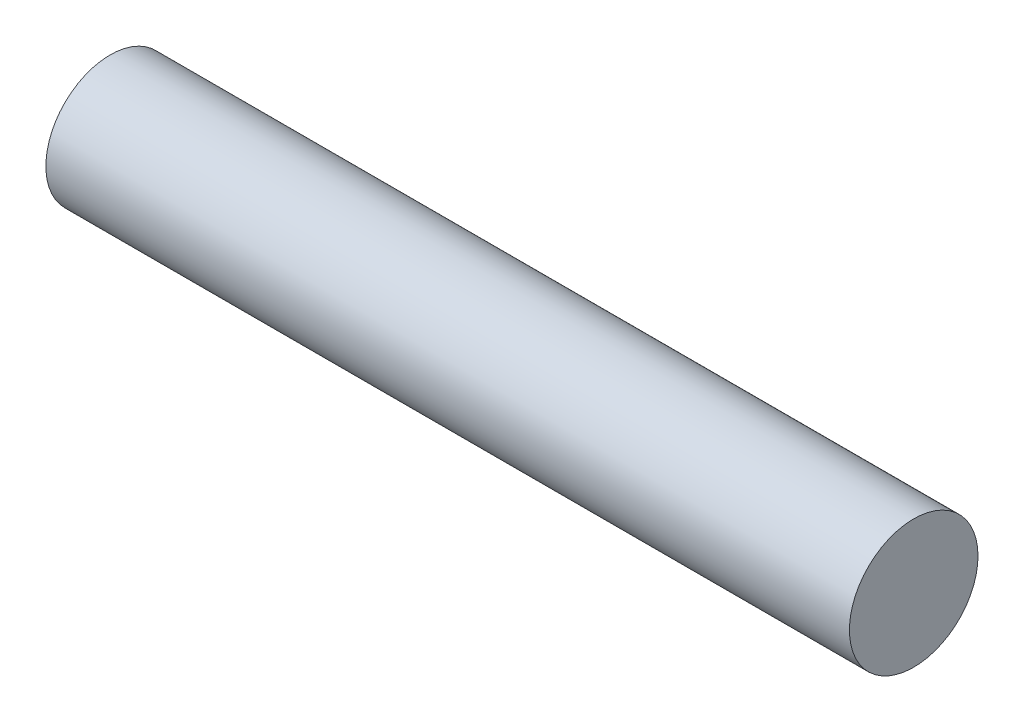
from build123d import *

# Parameters (mm, degrees)
SKETCH1_R           = 4
BOSS_EXTRUDE1_DEPTH = 50


with BuildPart() as part:
    # Sketch1 → Boss-Extrude1 (new body)
    with BuildSketch(Plane.YZ):
        with Locations(Location((0, 0, 0), (0, 0, 270))):
            Circle(SKETCH1_R)
    extrude(amount=BOSS_EXTRUDE1_DEPTH)


solid = part.part
